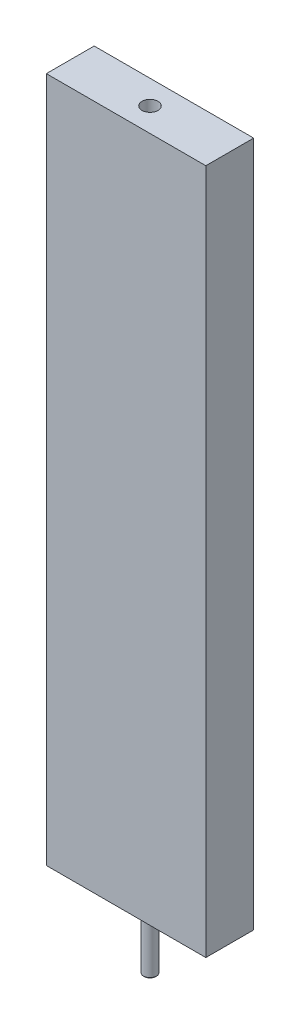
ISO-10303-21;
HEADER;
FILE_DESCRIPTION(('STEP AP214'),'2;1');
FILE_NAME('part.step','',(''),(''),'','','');
FILE_SCHEMA(('AUTOMOTIVE_DESIGN { 1 0 10303 214 1 1 1 1 }'));
ENDSEC;
DATA;
#1=APPLICATION_CONTEXT('core data for automotive mechanical design processes');
#2=APPLICATION_PROTOCOL_DEFINITION('international standard','automotive_design',2000,#1);
#3=PRODUCT_CONTEXT('',#1,'mechanical');
#4=PRODUCT('Part','Part','',(#3));
#5=PRODUCT_RELATED_PRODUCT_CATEGORY('part','',(#4));
#6=PRODUCT_DEFINITION_FORMATION('','',#4);
#7=PRODUCT_DEFINITION_CONTEXT('part definition',#1,'design');
#8=PRODUCT_DEFINITION('design','',#6,#7);
#9=PRODUCT_DEFINITION_SHAPE('','',#8);
#10=(LENGTH_UNIT() NAMED_UNIT(*) SI_UNIT(.MILLI.,.METRE.));
#11=(NAMED_UNIT(*) PLANE_ANGLE_UNIT() SI_UNIT($,.RADIAN.));
#12=(NAMED_UNIT(*) SI_UNIT($,.STERADIAN.) SOLID_ANGLE_UNIT());
#13=UNCERTAINTY_MEASURE_WITH_UNIT(LENGTH_MEASURE(1.E-05),#10,'distance_accuracy_value','');
#14=(GEOMETRIC_REPRESENTATION_CONTEXT(3) GLOBAL_UNCERTAINTY_ASSIGNED_CONTEXT((#13)) GLOBAL_UNIT_ASSIGNED_CONTEXT((#10,
#11,#12)) REPRESENTATION_CONTEXT('',''));
#15=CARTESIAN_POINT('',(0.,0.,0.));
#16=DIRECTION('',(0.,0.,1.));
#17=DIRECTION('',(1.,0.,0.));
#18=AXIS2_PLACEMENT_3D('',#15,#16,#17);
#19=CARTESIAN_POINT('',(0.,0.,30.));
#20=DIRECTION('',(0.,1.,0.));
#21=DIRECTION('',(0.,0.,1.));
#22=AXIS2_PLACEMENT_3D('',#19,#20,#21);
#23=PLANE('',#22);
#24=DIRECTION('',(1.,0.,0.));
#25=VECTOR('',#24,1.);
#26=CARTESIAN_POINT('',(0.,0.,0.));
#27=LINE('',#26,#25);
#28=CARTESIAN_POINT('',(0.,0.,0.));
#29=VERTEX_POINT('',#28);
#30=CARTESIAN_POINT('',(100.,0.,0.));
#31=VERTEX_POINT('',#30);
#32=EDGE_CURVE('E57',#29,#31,#27,.T.);
#33=ORIENTED_EDGE('',*,*,#32,.T.);
#34=DIRECTION('',(0.,0.,-1.));
#35=VECTOR('',#34,1.);
#36=CARTESIAN_POINT('',(100.,0.,30.));
#37=LINE('',#36,#35);
#38=CARTESIAN_POINT('',(100.,0.,30.));
#39=VERTEX_POINT('',#38);
#40=EDGE_CURVE('E75',#39,#31,#37,.T.);
#41=ORIENTED_EDGE('',*,*,#40,.F.);
#42=DIRECTION('',(1.,0.,0.));
#43=VECTOR('',#42,1.);
#44=CARTESIAN_POINT('',(0.,0.,30.));
#45=LINE('',#44,#43);
#46=CARTESIAN_POINT('',(0.,0.,30.));
#47=VERTEX_POINT('',#46);
#48=EDGE_CURVE('E71',#47,#39,#45,.T.);
#49=ORIENTED_EDGE('',*,*,#48,.F.);
#50=DIRECTION('',(0.,0.,-1.));
#51=VECTOR('',#50,1.);
#52=CARTESIAN_POINT('',(0.,0.,30.));
#53=LINE('',#52,#51);
#54=EDGE_CURVE('E69',#47,#29,#53,.T.);
#55=ORIENTED_EDGE('',*,*,#54,.T.);
#56=EDGE_LOOP('',(#33,#41,#49,#55));
#57=FACE_BOUND('',#56,.T.);
#58=CARTESIAN_POINT('',(50.,0.,15.));
#59=DIRECTION('',(0.,1.,0.));
#60=DIRECTION('',(0.,0.,1.));
#61=AXIS2_PLACEMENT_3D('',#58,#59,#60);
#62=CIRCLE('',#61,4.);
#63=CARTESIAN_POINT('',(50.,0.,19.));
#64=VERTEX_POINT('',#63);
#65=EDGE_CURVE('E74',#64,#64,#62,.F.);
#66=ORIENTED_EDGE('',*,*,#65,.F.);
#67=EDGE_LOOP('',(#66));
#68=FACE_BOUND('',#67,.T.);
#69=ADVANCED_FACE('F16',(#57,#68),#23,.F.);
#70=CARTESIAN_POINT('',(0.,0.,30.));
#71=DIRECTION('',(1.,0.,0.));
#72=DIRECTION('',(0.,0.,-1.));
#73=AXIS2_PLACEMENT_3D('',#70,#71,#72);
#74=PLANE('',#73);
#75=DIRECTION('',(0.,-1.,0.));
#76=VECTOR('',#75,1.);
#77=CARTESIAN_POINT('',(0.,0.,0.));
#78=LINE('',#77,#76);
#79=CARTESIAN_POINT('',(0.,430.,0.));
#80=VERTEX_POINT('',#79);
#81=EDGE_CURVE('E62',#80,#29,#78,.T.);
#82=ORIENTED_EDGE('',*,*,#81,.T.);
#83=ORIENTED_EDGE('',*,*,#54,.F.);
#84=DIRECTION('',(0.,-1.,0.));
#85=VECTOR('',#84,1.);
#86=CARTESIAN_POINT('',(0.,0.,30.));
#87=LINE('',#86,#85);
#88=CARTESIAN_POINT('',(0.,430.,30.));
#89=VERTEX_POINT('',#88);
#90=EDGE_CURVE('E89',#89,#47,#87,.T.);
#91=ORIENTED_EDGE('',*,*,#90,.F.);
#92=DIRECTION('',(0.,0.,-1.));
#93=VECTOR('',#92,1.);
#94=CARTESIAN_POINT('',(0.,430.,30.));
#95=LINE('',#94,#93);
#96=EDGE_CURVE('E78',#89,#80,#95,.T.);
#97=ORIENTED_EDGE('',*,*,#96,.T.);
#98=EDGE_LOOP('',(#82,#83,#91,#97));
#99=FACE_BOUND('',#98,.T.);
#100=ADVANCED_FACE('F18',(#99),#74,.F.);
#101=CARTESIAN_POINT('',(100.,0.,30.));
#102=DIRECTION('',(-1.,0.,0.));
#103=DIRECTION('',(0.,-1.,0.));
#104=AXIS2_PLACEMENT_3D('',#101,#102,#103);
#105=PLANE('',#104);
#106=DIRECTION('',(0.,1.,0.));
#107=VECTOR('',#106,1.);
#108=CARTESIAN_POINT('',(100.,0.,0.));
#109=LINE('',#108,#107);
#110=CARTESIAN_POINT('',(100.,430.,0.));
#111=VERTEX_POINT('',#110);
#112=EDGE_CURVE('E63',#31,#111,#109,.T.);
#113=ORIENTED_EDGE('',*,*,#112,.T.);
#114=DIRECTION('',(0.,0.,-1.));
#115=VECTOR('',#114,1.);
#116=CARTESIAN_POINT('',(100.,430.,30.));
#117=LINE('',#116,#115);
#118=CARTESIAN_POINT('',(100.,430.,30.));
#119=VERTEX_POINT('',#118);
#120=EDGE_CURVE('E95',#119,#111,#117,.T.);
#121=ORIENTED_EDGE('',*,*,#120,.F.);
#122=DIRECTION('',(0.,1.,0.));
#123=VECTOR('',#122,1.);
#124=CARTESIAN_POINT('',(100.,0.,30.));
#125=LINE('',#124,#123);
#126=EDGE_CURVE('E36',#39,#119,#125,.T.);
#127=ORIENTED_EDGE('',*,*,#126,.F.);
#128=ORIENTED_EDGE('',*,*,#40,.T.);
#129=EDGE_LOOP('',(#113,#121,#127,#128));
#130=FACE_BOUND('',#129,.T.);
#131=ADVANCED_FACE('F120',(#130),#105,.F.);
#132=CARTESIAN_POINT('',(0.,430.,30.));
#133=DIRECTION('',(0.,-1.,0.));
#134=DIRECTION('',(0.,0.,-1.));
#135=AXIS2_PLACEMENT_3D('',#132,#133,#134);
#136=PLANE('',#135);
#137=CARTESIAN_POINT('',(50.,430.,15.));
#138=DIRECTION('',(0.,1.,0.));
#139=DIRECTION('',(0.,0.,1.));
#140=AXIS2_PLACEMENT_3D('',#137,#138,#139);
#141=CIRCLE('',#140,5.);
#142=CARTESIAN_POINT('',(50.,430.,20.));
#143=VERTEX_POINT('',#142);
#144=EDGE_CURVE('E82',#143,#143,#141,.T.);
#145=ORIENTED_EDGE('',*,*,#144,.F.);
#146=EDGE_LOOP('',(#145));
#147=FACE_BOUND('',#146,.T.);
#148=DIRECTION('',(-1.,0.,0.));
#149=VECTOR('',#148,1.);
#150=CARTESIAN_POINT('',(0.,430.,0.));
#151=LINE('',#150,#149);
#152=EDGE_CURVE('E87',#111,#80,#151,.T.);
#153=ORIENTED_EDGE('',*,*,#152,.T.);
#154=ORIENTED_EDGE('',*,*,#96,.F.);
#155=DIRECTION('',(-1.,0.,0.));
#156=VECTOR('',#155,1.);
#157=CARTESIAN_POINT('',(0.,430.,30.));
#158=LINE('',#157,#156);
#159=EDGE_CURVE('E31',#119,#89,#158,.T.);
#160=ORIENTED_EDGE('',*,*,#159,.F.);
#161=ORIENTED_EDGE('',*,*,#120,.T.);
#162=EDGE_LOOP('',(#153,#154,#160,#161));
#163=FACE_BOUND('',#162,.T.);
#164=ADVANCED_FACE('F124',(#147,#163),#136,.F.);
#165=CARTESIAN_POINT('',(0.,430.,30.));
#166=DIRECTION('',(0.,0.,-1.));
#167=DIRECTION('',(-1.,0.,0.));
#168=AXIS2_PLACEMENT_3D('',#165,#166,#167);
#169=PLANE('',#168);
#170=ORIENTED_EDGE('',*,*,#90,.T.);
#171=ORIENTED_EDGE('',*,*,#48,.T.);
#172=ORIENTED_EDGE('',*,*,#126,.T.);
#173=ORIENTED_EDGE('',*,*,#159,.T.);
#174=EDGE_LOOP('',(#170,#171,#172,#173));
#175=FACE_BOUND('',#174,.T.);
#176=ADVANCED_FACE('F128',(#175),#169,.F.);
#177=CARTESIAN_POINT('',(0.,430.,0.));
#178=DIRECTION('',(0.,0.,-1.));
#179=DIRECTION('',(-1.,0.,0.));
#180=AXIS2_PLACEMENT_3D('',#177,#178,#179);
#181=PLANE('',#180);
#182=ORIENTED_EDGE('',*,*,#81,.F.);
#183=ORIENTED_EDGE('',*,*,#152,.F.);
#184=ORIENTED_EDGE('',*,*,#112,.F.);
#185=ORIENTED_EDGE('',*,*,#32,.F.);
#186=EDGE_LOOP('',(#182,#183,#184,#185));
#187=FACE_BOUND('',#186,.T.);
#188=ADVANCED_FACE('F59',(#187),#181,.T.);
#189=CARTESIAN_POINT('',(50.,394.,15.));
#190=DIRECTION('',(0.,1.,0.));
#191=DIRECTION('',(0.,0.,1.));
#192=AXIS2_PLACEMENT_3D('',#189,#190,#191);
#193=CYLINDRICAL_SURFACE('',#192,5.);
#194=CARTESIAN_POINT('',(50.,394.,15.));
#195=DIRECTION('',(0.,1.,0.));
#196=DIRECTION('',(0.,0.,1.));
#197=AXIS2_PLACEMENT_3D('',#194,#195,#196);
#198=CIRCLE('',#197,5.);
#199=CARTESIAN_POINT('',(50.,394.,20.));
#200=VERTEX_POINT('',#199);
#201=EDGE_CURVE('E79',#200,#200,#198,.T.);
#202=ORIENTED_EDGE('',*,*,#201,.F.);
#203=EDGE_LOOP('',(#202));
#204=FACE_BOUND('',#203,.T.);
#205=ORIENTED_EDGE('',*,*,#144,.T.);
#206=EDGE_LOOP('',(#205));
#207=FACE_BOUND('',#206,.T.);
#208=ADVANCED_FACE('F134',(#204,#207),#193,.F.);
#209=CARTESIAN_POINT('',(50.,394.,15.));
#210=DIRECTION('',(0.,1.,0.));
#211=DIRECTION('',(0.,0.,1.));
#212=AXIS2_PLACEMENT_3D('',#209,#210,#211);
#213=PLANE('',#212);
#214=ORIENTED_EDGE('',*,*,#201,.T.);
#215=EDGE_LOOP('',(#214));
#216=FACE_BOUND('',#215,.T.);
#217=ADVANCED_FACE('F137',(#216),#213,.T.);
#218=CARTESIAN_POINT('',(50.,-41.,15.));
#219=DIRECTION('',(0.,1.,0.));
#220=DIRECTION('',(0.,0.,1.));
#221=AXIS2_PLACEMENT_3D('',#218,#219,#220);
#222=CYLINDRICAL_SURFACE('',#221,4.);
#223=CARTESIAN_POINT('',(50.,-40.5,15.));
#224=DIRECTION('',(0.,-1.,0.));
#225=DIRECTION('',(0.,0.,-1.));
#226=AXIS2_PLACEMENT_3D('',#223,#224,#225);
#227=CIRCLE('',#226,4.);
#228=CARTESIAN_POINT('',(50.,-40.5,11.));
#229=VERTEX_POINT('',#228);
#230=EDGE_CURVE('E11',#229,#229,#227,.F.);
#231=ORIENTED_EDGE('',*,*,#230,.T.);
#232=EDGE_LOOP('',(#231));
#233=FACE_BOUND('',#232,.T.);
#234=ORIENTED_EDGE('',*,*,#65,.T.);
#235=EDGE_LOOP('',(#234));
#236=FACE_BOUND('',#235,.T.);
#237=ADVANCED_FACE('F113',(#233,#236),#222,.T.);
#238=CARTESIAN_POINT('',(50.,-41.,15.));
#239=DIRECTION('',(0.,-1.,0.));
#240=DIRECTION('',(0.,0.,-1.));
#241=AXIS2_PLACEMENT_3D('',#238,#239,#240);
#242=PLANE('',#241);
#243=CARTESIAN_POINT('',(50.,-41.,15.));
#244=DIRECTION('',(0.,-1.,0.));
#245=DIRECTION('',(0.,0.,-1.));
#246=AXIS2_PLACEMENT_3D('',#243,#244,#245);
#247=CIRCLE('',#246,3.5);
#248=CARTESIAN_POINT('',(50.,-41.,11.5));
#249=VERTEX_POINT('',#248);
#250=EDGE_CURVE('E24',#249,#249,#247,.T.);
#251=ORIENTED_EDGE('',*,*,#250,.T.);
#252=EDGE_LOOP('',(#251));
#253=FACE_BOUND('',#252,.T.);
#254=ADVANCED_FACE('F103',(#253),#242,.T.);
#255=CARTESIAN_POINT('',(50.,-40.5,15.));
#256=DIRECTION('',(0.,-1.,0.));
#257=DIRECTION('',(0.,0.,-1.));
#258=AXIS2_PLACEMENT_3D('',#255,#256,#257);
#259=TOROIDAL_SURFACE('',#258,3.5,0.5);
#260=ORIENTED_EDGE('',*,*,#230,.F.);
#261=EDGE_LOOP('',(#260));
#262=FACE_BOUND('',#261,.T.);
#263=ORIENTED_EDGE('',*,*,#250,.F.);
#264=EDGE_LOOP('',(#263));
#265=FACE_BOUND('',#264,.T.);
#266=ADVANCED_FACE('F105',(#262,#265),#259,.T.);
#267=CLOSED_SHELL('',(#69,#100,#131,#164,#176,#188,#208,#217,#237,#254,#266));
#268=MANIFOLD_SOLID_BREP('B1',#267);
#269=ADVANCED_BREP_SHAPE_REPRESENTATION('',(#18,#268),#14);
#270=SHAPE_DEFINITION_REPRESENTATION(#9,#269);
ENDSEC;
END-ISO-10303-21;
